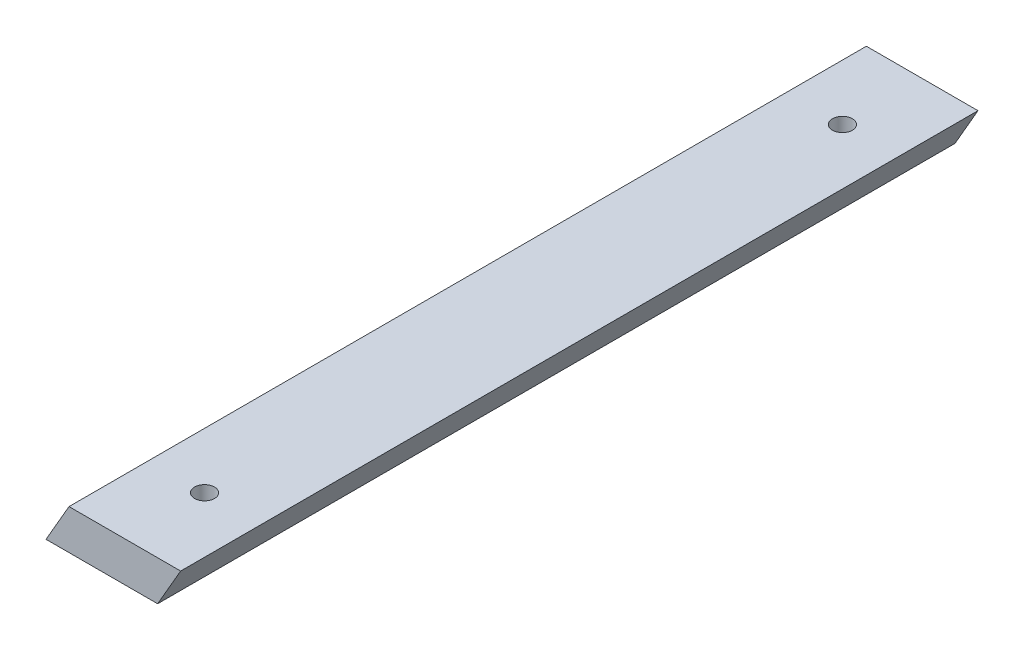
from build123d import *

# Parameters (mm, degrees)
BOSS_EXTRUDE1_DEPTH = 100
SKETCH2_R           = 2.5
CUT_EXTRUDE1_DEPTH  = 103.425540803


with BuildPart() as part:
    # Sketch1 → Boss-Extrude1 (new, symmetric)
    with BuildSketch(Plane.XY):
        Polygon((-14, 5), (-19.773502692, -5), (-14, -5), align=None)
        Polygon((8.226497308, -5), (14, 5), (-14, 5), (-14, -5), align=None)
    extrude(amount=BOSS_EXTRUDE1_DEPTH, both=True)

    # Sketch2 → Cut-Extrude1 (cut, through all)
    with BuildSketch(Plane(origin=(0, 5, 0), x_dir=(1, 0, 0), z_dir=(0, 1, 0))):
        with Locations(Location((0, -80, 0), (0, 0, 180))):
            Circle(SKETCH2_R)
    cut_extrude1 = extrude(amount=-CUT_EXTRUDE1_DEPTH, mode=Mode.SUBTRACT)

    # Mirror1: Cut-Extrude1 across plane
    add(cut_extrude1.mirror(Plane.XY), mode=Mode.SUBTRACT)


solid = part.part
